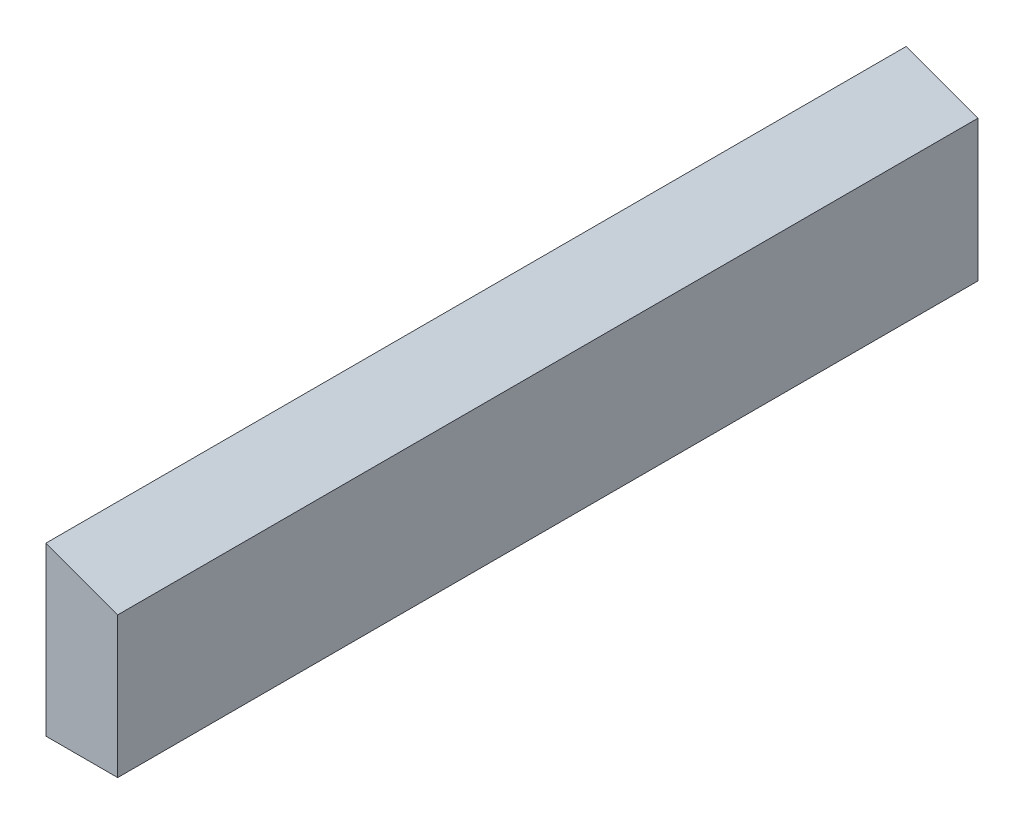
from build123d import *

# Parameters (mm, degrees)
SKETCH1_W           = 38.1
SKETCH1_H           = 88.9
BOSS_EXTRUDE1_DEPTH = 457.2
CUT_EXTRUDE1_DEPTH  = 460.750524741


with BuildPart() as part:
    # Sketch1 → Boss-Extrude1 (new body)
    with BuildSketch(Plane.XY):
        Rectangle(SKETCH1_W, SKETCH1_H)
    extrude(amount=-BOSS_EXTRUDE1_DEPTH)

    # Sketch2 → Cut-Extrude1 (cut, through all)
    with BuildSketch(Plane.XY):
        Polygon((-19.05, 44.45), (19.05, 30.450801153), (19.05, 44.45), align=None)
    extrude(amount=-CUT_EXTRUDE1_DEPTH, mode=Mode.SUBTRACT)


solid = part.part
